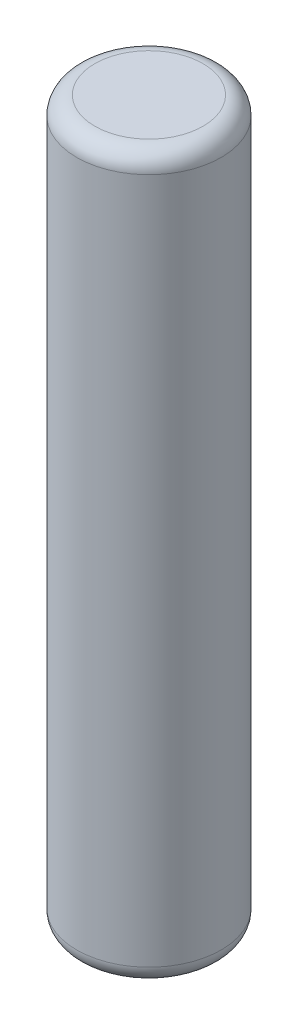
from build123d import *

# Parameters (mm, degrees)
SKETCH1_R           = 4
BOSS_EXTRUDE1_DEPTH = 40
FILLET1_R           = 1


with BuildPart() as part:
    # Sketch1 → Boss-Extrude1 (new body)
    with BuildSketch(Plane(origin=(0, 0, 0), x_dir=(1, 0, 0), z_dir=(0, 1, 0))):
        with Locations(Location((0, 0, 0), (0, 0, 270))):
            Circle(SKETCH1_R)
    extrude(amount=BOSS_EXTRUDE1_DEPTH)

    # Fillet1
    fillet1_edges = [part.edges().sort_by_distance(p)[0] for p in [
        (0, 0, -4),
        (0, 40, -4),
    ]]
    fillet(fillet1_edges, radius=FILLET1_R)


solid = part.part
